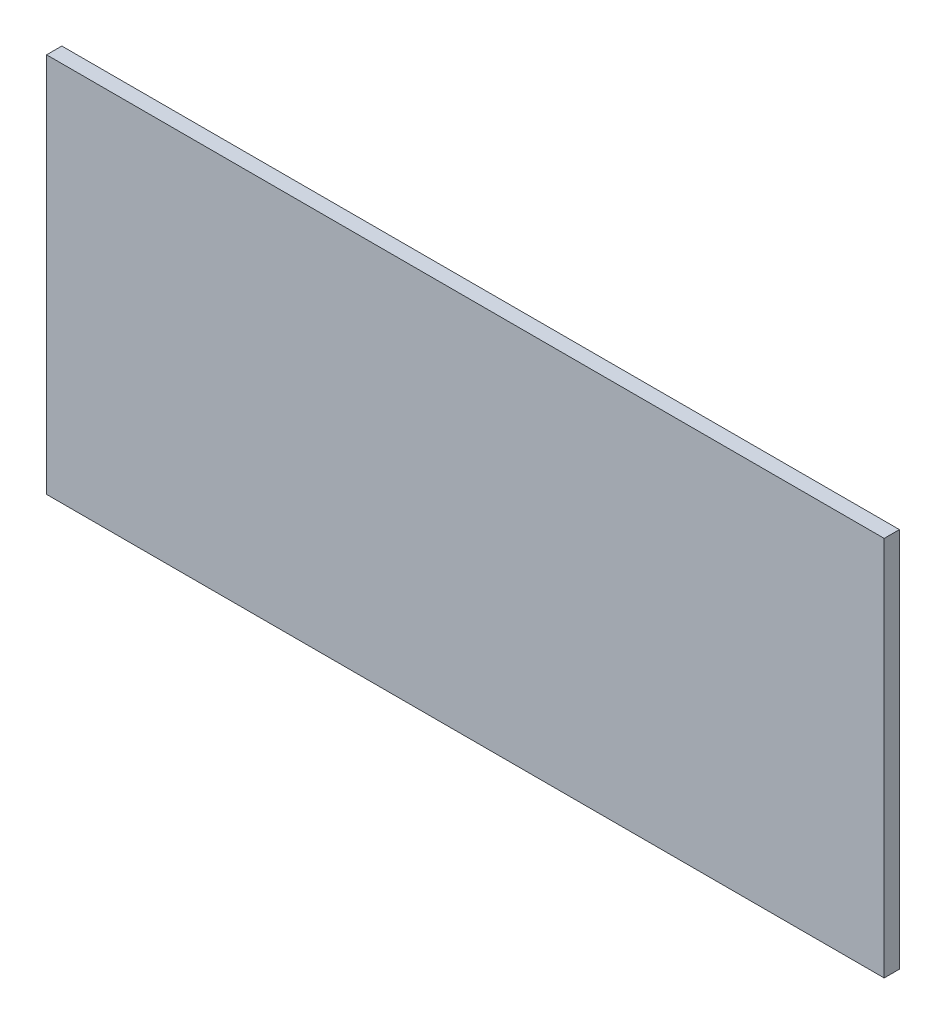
from build123d import *

# Parameters (mm, degrees)
ESQUISSE1_W        = 11000
ESQUISSE1_H        = 5000
BOSS_EXTRU_1_DEPTH = 200


with BuildPart() as part:
    # Esquisse1 → Boss.-Extru.1 (new body)
    with BuildSketch(Plane.XY):
        Rectangle(ESQUISSE1_W, ESQUISSE1_H)
    extrude(amount=BOSS_EXTRU_1_DEPTH)


solid = part.part
